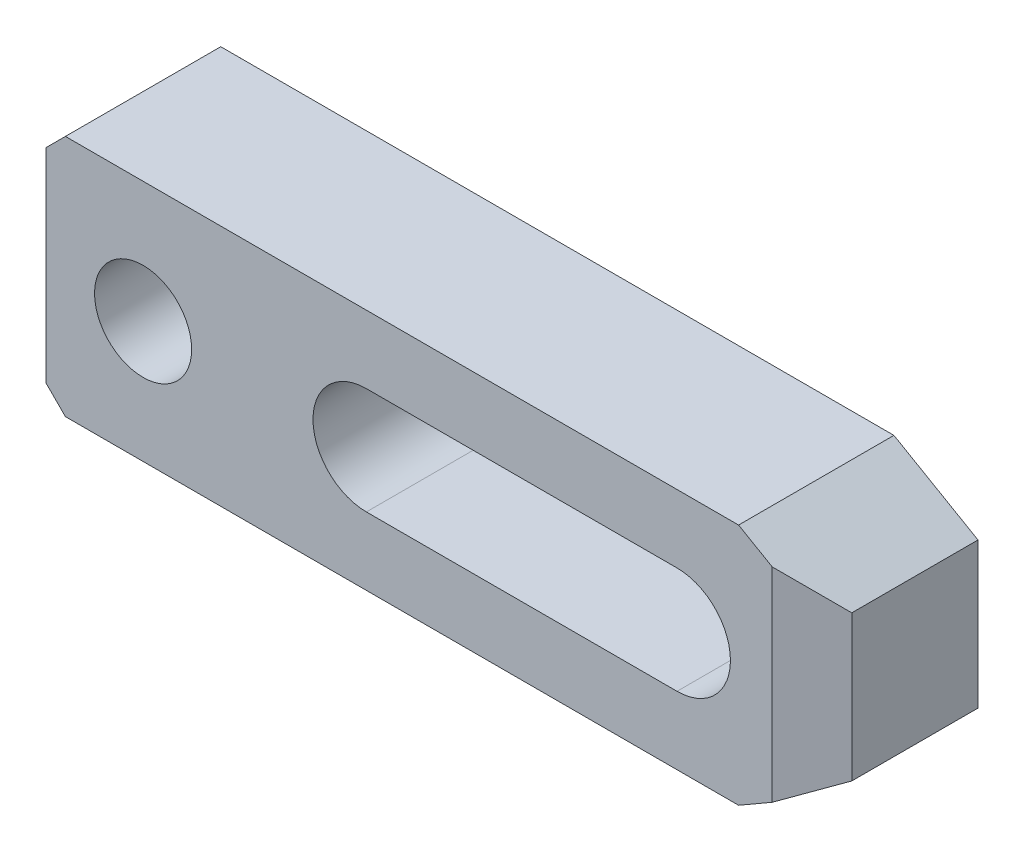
ISO-10303-21;
HEADER;
FILE_DESCRIPTION(('STEP AP214'),'2;1');
FILE_NAME('part.step','',(''),(''),'','','');
FILE_SCHEMA(('AUTOMOTIVE_DESIGN { 1 0 10303 214 1 1 1 1 }'));
ENDSEC;
DATA;
#1=APPLICATION_CONTEXT('core data for automotive mechanical design processes');
#2=APPLICATION_PROTOCOL_DEFINITION('international standard','automotive_design',2000,#1);
#3=PRODUCT_CONTEXT('',#1,'mechanical');
#4=PRODUCT('Part','Part','',(#3));
#5=PRODUCT_RELATED_PRODUCT_CATEGORY('part','',(#4));
#6=PRODUCT_DEFINITION_FORMATION('','',#4);
#7=PRODUCT_DEFINITION_CONTEXT('part definition',#1,'design');
#8=PRODUCT_DEFINITION('design','',#6,#7);
#9=PRODUCT_DEFINITION_SHAPE('','',#8);
#10=(LENGTH_UNIT() NAMED_UNIT(*) SI_UNIT(.MILLI.,.METRE.));
#11=(NAMED_UNIT(*) PLANE_ANGLE_UNIT() SI_UNIT($,.RADIAN.));
#12=(NAMED_UNIT(*) SI_UNIT($,.STERADIAN.) SOLID_ANGLE_UNIT());
#13=UNCERTAINTY_MEASURE_WITH_UNIT(LENGTH_MEASURE(1.E-05),#10,'distance_accuracy_value','');
#14=(GEOMETRIC_REPRESENTATION_CONTEXT(3) GLOBAL_UNCERTAINTY_ASSIGNED_CONTEXT((#13)) GLOBAL_UNIT_ASSIGNED_CONTEXT((#10,
#11,#12)) REPRESENTATION_CONTEXT('',''));
#15=CARTESIAN_POINT('',(0.,0.,0.));
#16=DIRECTION('',(0.,0.,1.));
#17=DIRECTION('',(1.,0.,0.));
#18=AXIS2_PLACEMENT_3D('',#15,#16,#17);
#19=CARTESIAN_POINT('',(-37.6198914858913,37.8801085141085,0.));
#20=DIRECTION('',(0.,0.,1.));
#21=DIRECTION('',(-1.,0.,0.));
#22=AXIS2_PLACEMENT_3D('',#19,#20,#21);
#23=PLANE('',#22);
#24=DIRECTION('',(0.,1.,0.));
#25=VECTOR('',#24,1.);
#26=CARTESIAN_POINT('',(-65.,-10.5,0.));
#27=LINE('',#26,#25);
#28=CARTESIAN_POINT('',(-65.,-10.5,0.));
#29=VERTEX_POINT('',#28);
#30=CARTESIAN_POINT('',(-65.,-5.5,0.));
#31=VERTEX_POINT('',#30);
#32=EDGE_CURVE('E147',#29,#31,#27,.T.);
#33=ORIENTED_EDGE('',*,*,#32,.T.);
#34=DIRECTION('',(-1.,0.,0.));
#35=VECTOR('',#34,1.);
#36=CARTESIAN_POINT('',(0.,-5.5,0.));
#37=LINE('',#36,#35);
#38=CARTESIAN_POINT('',(0.,-5.5,0.));
#39=VERTEX_POINT('',#38);
#40=EDGE_CURVE('E237',#39,#31,#37,.T.);
#41=ORIENTED_EDGE('',*,*,#40,.F.);
#42=CARTESIAN_POINT('',(0.,0.,0.));
#43=DIRECTION('',(0.,0.,1.));
#44=DIRECTION('',(-1.,0.,0.));
#45=AXIS2_PLACEMENT_3D('',#42,#43,#44);
#46=CIRCLE('',#45,5.5);
#47=CARTESIAN_POINT('',(0.,5.5,0.));
#48=VERTEX_POINT('',#47);
#49=EDGE_CURVE('E128',#39,#48,#46,.T.);
#50=ORIENTED_EDGE('',*,*,#49,.T.);
#51=DIRECTION('',(1.,0.,0.));
#52=VECTOR('',#51,1.);
#53=CARTESIAN_POINT('',(-32.,5.5,0.));
#54=LINE('',#53,#52);
#55=CARTESIAN_POINT('',(-65.,5.5,0.));
#56=VERTEX_POINT('',#55);
#57=EDGE_CURVE('E119',#56,#48,#54,.T.);
#58=ORIENTED_EDGE('',*,*,#57,.F.);
#59=CARTESIAN_POINT('',(-65.,10.5,0.));
#60=VERTEX_POINT('',#59);
#61=EDGE_CURVE('E124',#56,#60,#27,.T.);
#62=ORIENTED_EDGE('',*,*,#61,.T.);
#63=DIRECTION('',(-0.70710678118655,-0.707106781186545,0.));
#64=VECTOR('',#63,1.);
#65=CARTESIAN_POINT('',(-63.,12.5,0.));
#66=LINE('',#65,#64);
#67=CARTESIAN_POINT('',(-63.,12.5,0.));
#68=VERTEX_POINT('',#67);
#69=EDGE_CURVE('E148',#68,#60,#66,.T.);
#70=ORIENTED_EDGE('',*,*,#69,.F.);
#71=DIRECTION('',(-1.,0.,0.));
#72=VECTOR('',#71,1.);
#73=CARTESIAN_POINT('',(6.3397459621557,12.5,0.));
#74=LINE('',#73,#72);
#75=CARTESIAN_POINT('',(6.3397459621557,12.5,0.));
#76=VERTEX_POINT('',#75);
#77=EDGE_CURVE('E151',#76,#68,#74,.T.);
#78=ORIENTED_EDGE('',*,*,#77,.F.);
#79=DIRECTION('',(-0.866025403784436,0.5,0.));
#80=VECTOR('',#79,1.);
#81=CARTESIAN_POINT('',(15.,7.5,0.));
#82=LINE('',#81,#80);
#83=CARTESIAN_POINT('',(15.,7.5,0.));
#84=VERTEX_POINT('',#83);
#85=EDGE_CURVE('E158',#84,#76,#82,.T.);
#86=ORIENTED_EDGE('',*,*,#85,.F.);
#87=DIRECTION('',(0.,-1.,0.));
#88=VECTOR('',#87,1.);
#89=CARTESIAN_POINT('',(15.,7.5,0.));
#90=LINE('',#89,#88);
#91=CARTESIAN_POINT('',(15.,-7.5,0.));
#92=VERTEX_POINT('',#91);
#93=EDGE_CURVE('E181',#84,#92,#90,.T.);
#94=ORIENTED_EDGE('',*,*,#93,.T.);
#95=DIRECTION('',(-0.86602540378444,-0.5,0.));
#96=VECTOR('',#95,1.);
#97=CARTESIAN_POINT('',(15.,-7.5,0.));
#98=LINE('',#97,#96);
#99=CARTESIAN_POINT('',(6.33974596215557,-12.5,0.));
#100=VERTEX_POINT('',#99);
#101=EDGE_CURVE('E208',#92,#100,#98,.T.);
#102=ORIENTED_EDGE('',*,*,#101,.T.);
#103=DIRECTION('',(-1.,0.,0.));
#104=VECTOR('',#103,1.);
#105=CARTESIAN_POINT('',(6.33974596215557,-12.5,0.));
#106=LINE('',#105,#104);
#107=CARTESIAN_POINT('',(-63.,-12.5,0.));
#108=VERTEX_POINT('',#107);
#109=EDGE_CURVE('E210',#100,#108,#106,.T.);
#110=ORIENTED_EDGE('',*,*,#109,.T.);
#111=DIRECTION('',(-0.707106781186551,0.707106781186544,0.));
#112=VECTOR('',#111,1.);
#113=CARTESIAN_POINT('',(-63.,-12.5,0.));
#114=LINE('',#113,#112);
#115=EDGE_CURVE('E150',#108,#29,#114,.T.);
#116=ORIENTED_EDGE('',*,*,#115,.T.);
#117=EDGE_LOOP('',(#33,#41,#50,#58,#62,#70,#78,#86,#94,#102,#110,#116));
#118=FACE_BOUND('',#117,.T.);
#119=ADVANCED_FACE('F14',(#118),#23,.F.);
#120=CARTESIAN_POINT('',(-65.,-10.5,16.));
#121=DIRECTION('',(-1.,0.,0.));
#122=DIRECTION('',(0.,0.,-1.));
#123=AXIS2_PLACEMENT_3D('',#120,#121,#122);
#124=PLANE('',#123);
#125=DIRECTION('',(0.,-1.,0.));
#126=VECTOR('',#125,1.);
#127=CARTESIAN_POINT('',(-65.,-10.5,5.));
#128=LINE('',#127,#126);
#129=CARTESIAN_POINT('',(-65.,5.5,5.));
#130=VERTEX_POINT('',#129);
#131=CARTESIAN_POINT('',(-65.,-5.5,5.));
#132=VERTEX_POINT('',#131);
#133=EDGE_CURVE('E141',#130,#132,#128,.T.);
#134=ORIENTED_EDGE('',*,*,#133,.T.);
#135=DIRECTION('',(0.,0.,-1.));
#136=VECTOR('',#135,1.);
#137=CARTESIAN_POINT('',(-65.,-5.5,16.));
#138=LINE('',#137,#136);
#139=EDGE_CURVE('E140',#132,#31,#138,.T.);
#140=ORIENTED_EDGE('',*,*,#139,.T.);
#141=ORIENTED_EDGE('',*,*,#32,.F.);
#142=DIRECTION('',(0.,0.,-1.));
#143=VECTOR('',#142,1.);
#144=CARTESIAN_POINT('',(-65.,-10.5,16.));
#145=LINE('',#144,#143);
#146=CARTESIAN_POINT('',(-65.,-10.5,16.));
#147=VERTEX_POINT('',#146);
#148=EDGE_CURVE('E189',#147,#29,#145,.T.);
#149=ORIENTED_EDGE('',*,*,#148,.F.);
#150=DIRECTION('',(0.,1.,0.));
#151=VECTOR('',#150,1.);
#152=CARTESIAN_POINT('',(-65.,-10.5,16.));
#153=LINE('',#152,#151);
#154=CARTESIAN_POINT('',(-65.,10.5,16.));
#155=VERTEX_POINT('',#154);
#156=EDGE_CURVE('E171',#147,#155,#153,.T.);
#157=ORIENTED_EDGE('',*,*,#156,.T.);
#158=DIRECTION('',(0.,0.,-1.));
#159=VECTOR('',#158,1.);
#160=CARTESIAN_POINT('',(-65.,10.5,16.));
#161=LINE('',#160,#159);
#162=EDGE_CURVE('E145',#155,#60,#161,.T.);
#163=ORIENTED_EDGE('',*,*,#162,.T.);
#164=ORIENTED_EDGE('',*,*,#61,.F.);
#165=DIRECTION('',(0.,0.,-1.));
#166=VECTOR('',#165,1.);
#167=CARTESIAN_POINT('',(-65.,5.5,16.));
#168=LINE('',#167,#166);
#169=EDGE_CURVE('E135',#130,#56,#168,.T.);
#170=ORIENTED_EDGE('',*,*,#169,.F.);
#171=EDGE_LOOP('',(#134,#140,#141,#149,#157,#163,#164,#170));
#172=FACE_BOUND('',#171,.T.);
#173=ADVANCED_FACE('F143',(#172),#124,.T.);
#174=CARTESIAN_POINT('',(-55.,0.,16.));
#175=DIRECTION('',(0.,0.,-1.));
#176=DIRECTION('',(1.,0.,0.));
#177=AXIS2_PLACEMENT_3D('',#174,#175,#176);
#178=CYLINDRICAL_SURFACE('',#177,5.);
#179=CARTESIAN_POINT('',(-55.,0.,16.));
#180=DIRECTION('',(0.,0.,1.));
#181=DIRECTION('',(-1.,0.,0.));
#182=AXIS2_PLACEMENT_3D('',#179,#180,#181);
#183=CIRCLE('',#182,5.);
#184=CARTESIAN_POINT('',(-60.,0.,16.));
#185=VERTEX_POINT('',#184);
#186=EDGE_CURVE('E161',#185,#185,#183,.T.);
#187=ORIENTED_EDGE('',*,*,#186,.T.);
#188=EDGE_LOOP('',(#187));
#189=FACE_BOUND('',#188,.T.);
#190=CARTESIAN_POINT('',(-55.,0.,5.));
#191=DIRECTION('',(0.,0.,-1.));
#192=DIRECTION('',(1.,0.,0.));
#193=AXIS2_PLACEMENT_3D('',#190,#191,#192);
#194=CIRCLE('',#193,5.);
#195=CARTESIAN_POINT('',(-50.,0.,5.));
#196=VERTEX_POINT('',#195);
#197=EDGE_CURVE('E398',#196,#196,#194,.T.);
#198=ORIENTED_EDGE('',*,*,#197,.T.);
#199=EDGE_LOOP('',(#198));
#200=FACE_BOUND('',#199,.T.);
#201=ADVANCED_FACE('F262',(#189,#200),#178,.F.);
#202=CARTESIAN_POINT('',(-32.,0.,16.));
#203=DIRECTION('',(0.,0.,-1.));
#204=DIRECTION('',(1.,0.,0.));
#205=AXIS2_PLACEMENT_3D('',#202,#203,#204);
#206=CYLINDRICAL_SURFACE('',#205,5.5);
#207=DIRECTION('',(0.,0.,-1.));
#208=VECTOR('',#207,1.);
#209=CARTESIAN_POINT('',(-32.,-5.5,16.));
#210=LINE('',#209,#208);
#211=CARTESIAN_POINT('',(-32.,-5.5,16.));
#212=VERTEX_POINT('',#211);
#213=CARTESIAN_POINT('',(-32.,-5.5,5.));
#214=VERTEX_POINT('',#213);
#215=EDGE_CURVE('E256',#212,#214,#210,.T.);
#216=ORIENTED_EDGE('',*,*,#215,.T.);
#217=CARTESIAN_POINT('',(-32.,0.,5.));
#218=DIRECTION('',(0.,0.,-1.));
#219=DIRECTION('',(1.,0.,0.));
#220=AXIS2_PLACEMENT_3D('',#217,#218,#219);
#221=CIRCLE('',#220,5.5);
#222=CARTESIAN_POINT('',(-32.,5.5,5.));
#223=VERTEX_POINT('',#222);
#224=EDGE_CURVE('E278',#214,#223,#221,.T.);
#225=ORIENTED_EDGE('',*,*,#224,.T.);
#226=DIRECTION('',(0.,0.,-1.));
#227=VECTOR('',#226,1.);
#228=CARTESIAN_POINT('',(-32.,5.5,16.));
#229=LINE('',#228,#227);
#230=CARTESIAN_POINT('',(-32.,5.5,16.));
#231=VERTEX_POINT('',#230);
#232=EDGE_CURVE('E244',#231,#223,#229,.T.);
#233=ORIENTED_EDGE('',*,*,#232,.F.);
#234=CARTESIAN_POINT('',(-32.,0.,16.));
#235=DIRECTION('',(0.,0.,1.));
#236=DIRECTION('',(-1.,0.,0.));
#237=AXIS2_PLACEMENT_3D('',#234,#235,#236);
#238=CIRCLE('',#237,5.5);
#239=EDGE_CURVE('E132',#231,#212,#238,.T.);
#240=ORIENTED_EDGE('',*,*,#239,.T.);
#241=EDGE_LOOP('',(#216,#225,#233,#240));
#242=FACE_BOUND('',#241,.T.);
#243=ADVANCED_FACE('F269',(#242),#206,.F.);
#244=CARTESIAN_POINT('',(-37.6198914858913,37.8801085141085,16.));
#245=DIRECTION('',(0.,0.,1.));
#246=DIRECTION('',(-1.,0.,0.));
#247=AXIS2_PLACEMENT_3D('',#244,#245,#246);
#248=PLANE('',#247);
#249=DIRECTION('',(0.,-1.,0.));
#250=VECTOR('',#249,1.);
#251=CARTESIAN_POINT('',(9.80384757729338,37.8801085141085,16.));
#252=LINE('',#251,#250);
#253=CARTESIAN_POINT('',(9.80384757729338,10.5,16.));
#254=VERTEX_POINT('',#253);
#255=CARTESIAN_POINT('',(9.80384757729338,-10.5,16.));
#256=VERTEX_POINT('',#255);
#257=EDGE_CURVE('E233',#254,#256,#252,.T.);
#258=ORIENTED_EDGE('',*,*,#257,.F.);
#259=DIRECTION('',(-0.866025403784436,0.5,0.));
#260=VECTOR('',#259,1.);
#261=CARTESIAN_POINT('',(15.,7.5,16.));
#262=LINE('',#261,#260);
#263=CARTESIAN_POINT('',(6.3397459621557,12.5,16.));
#264=VERTEX_POINT('',#263);
#265=EDGE_CURVE('E179',#254,#264,#262,.T.);
#266=ORIENTED_EDGE('',*,*,#265,.T.);
#267=DIRECTION('',(-1.,0.,0.));
#268=VECTOR('',#267,1.);
#269=CARTESIAN_POINT('',(6.3397459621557,12.5,16.));
#270=LINE('',#269,#268);
#271=CARTESIAN_POINT('',(-63.,12.5,16.));
#272=VERTEX_POINT('',#271);
#273=EDGE_CURVE('E176',#264,#272,#270,.T.);
#274=ORIENTED_EDGE('',*,*,#273,.T.);
#275=DIRECTION('',(-0.70710678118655,-0.707106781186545,0.));
#276=VECTOR('',#275,1.);
#277=CARTESIAN_POINT('',(-63.,12.5,16.));
#278=LINE('',#277,#276);
#279=EDGE_CURVE('E173',#272,#155,#278,.T.);
#280=ORIENTED_EDGE('',*,*,#279,.T.);
#281=ORIENTED_EDGE('',*,*,#156,.F.);
#282=DIRECTION('',(-0.707106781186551,0.707106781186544,0.));
#283=VECTOR('',#282,1.);
#284=CARTESIAN_POINT('',(-63.,-12.5,16.));
#285=LINE('',#284,#283);
#286=CARTESIAN_POINT('',(-63.,-12.5,16.));
#287=VERTEX_POINT('',#286);
#288=EDGE_CURVE('E168',#287,#147,#285,.T.);
#289=ORIENTED_EDGE('',*,*,#288,.F.);
#290=DIRECTION('',(-1.,0.,0.));
#291=VECTOR('',#290,1.);
#292=CARTESIAN_POINT('',(6.33974596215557,-12.5,16.));
#293=LINE('',#292,#291);
#294=CARTESIAN_POINT('',(6.33974596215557,-12.5,16.));
#295=VERTEX_POINT('',#294);
#296=EDGE_CURVE('E165',#295,#287,#293,.T.);
#297=ORIENTED_EDGE('',*,*,#296,.F.);
#298=DIRECTION('',(-0.86602540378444,-0.5,0.));
#299=VECTOR('',#298,1.);
#300=CARTESIAN_POINT('',(15.,-7.5,16.));
#301=LINE('',#300,#299);
#302=EDGE_CURVE('E162',#256,#295,#301,.T.);
#303=ORIENTED_EDGE('',*,*,#302,.F.);
#304=EDGE_LOOP('',(#258,#266,#274,#280,#281,#289,#297,#303));
#305=FACE_BOUND('',#304,.T.);
#306=ORIENTED_EDGE('',*,*,#186,.F.);
#307=EDGE_LOOP('',(#306));
#308=FACE_BOUND('',#307,.T.);
#309=DIRECTION('',(-1.,0.,0.));
#310=VECTOR('',#309,1.);
#311=CARTESIAN_POINT('',(0.,-5.5,16.));
#312=LINE('',#311,#310);
#313=CARTESIAN_POINT('',(0.,-5.5,16.));
#314=VERTEX_POINT('',#313);
#315=EDGE_CURVE('E247',#314,#212,#312,.T.);
#316=ORIENTED_EDGE('',*,*,#315,.T.);
#317=ORIENTED_EDGE('',*,*,#239,.F.);
#318=DIRECTION('',(1.,0.,0.));
#319=VECTOR('',#318,1.);
#320=CARTESIAN_POINT('',(-32.,5.5,16.));
#321=LINE('',#320,#319);
#322=CARTESIAN_POINT('',(0.,5.5,16.));
#323=VERTEX_POINT('',#322);
#324=EDGE_CURVE('E241',#231,#323,#321,.T.);
#325=ORIENTED_EDGE('',*,*,#324,.T.);
#326=CARTESIAN_POINT('',(0.,0.,16.));
#327=DIRECTION('',(0.,0.,1.));
#328=DIRECTION('',(-1.,0.,0.));
#329=AXIS2_PLACEMENT_3D('',#326,#327,#328);
#330=CIRCLE('',#329,5.5);
#331=EDGE_CURVE('E245',#314,#323,#330,.T.);
#332=ORIENTED_EDGE('',*,*,#331,.F.);
#333=EDGE_LOOP('',(#316,#317,#325,#332));
#334=FACE_BOUND('',#333,.T.);
#335=ADVANCED_FACE('F265',(#305,#308,#334),#248,.T.);
#336=CARTESIAN_POINT('',(15.,7.5,16.));
#337=DIRECTION('',(-0.5,-0.866025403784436,0.));
#338=DIRECTION('',(0.866025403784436,-0.5,0.));
#339=AXIS2_PLACEMENT_3D('',#336,#337,#338);
#340=PLANE('',#339);
#341=ORIENTED_EDGE('',*,*,#265,.F.);
#342=DIRECTION('',(0.774596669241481,-0.447213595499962,-0.447213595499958));
#343=VECTOR('',#342,1.);
#344=CARTESIAN_POINT('',(13.9607695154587,8.1,13.6));
#345=LINE('',#344,#343);
#346=CARTESIAN_POINT('',(15.,7.5,13.));
#347=VERTEX_POINT('',#346);
#348=EDGE_CURVE('E235',#254,#347,#345,.T.);
#349=ORIENTED_EDGE('',*,*,#348,.T.);
#350=DIRECTION('',(0.,0.,-1.));
#351=VECTOR('',#350,1.);
#352=CARTESIAN_POINT('',(15.,7.5,16.));
#353=LINE('',#352,#351);
#354=EDGE_CURVE('E164',#347,#84,#353,.T.);
#355=ORIENTED_EDGE('',*,*,#354,.T.);
#356=ORIENTED_EDGE('',*,*,#85,.T.);
#357=DIRECTION('',(0.,0.,-1.));
#358=VECTOR('',#357,1.);
#359=CARTESIAN_POINT('',(6.3397459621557,12.5,16.));
#360=LINE('',#359,#358);
#361=EDGE_CURVE('E9',#264,#76,#360,.T.);
#362=ORIENTED_EDGE('',*,*,#361,.F.);
#363=EDGE_LOOP('',(#341,#349,#355,#356,#362));
#364=FACE_BOUND('',#363,.T.);
#365=ADVANCED_FACE('F268',(#364),#340,.F.);
#366=CARTESIAN_POINT('',(6.3397459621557,12.5,16.));
#367=DIRECTION('',(0.,-1.,0.));
#368=DIRECTION('',(0.,0.,1.));
#369=AXIS2_PLACEMENT_3D('',#366,#367,#368);
#370=PLANE('',#369);
#371=DIRECTION('',(0.,0.,-1.));
#372=VECTOR('',#371,1.);
#373=CARTESIAN_POINT('',(-63.,12.5,16.));
#374=LINE('',#373,#372);
#375=EDGE_CURVE('E22',#272,#68,#374,.T.);
#376=ORIENTED_EDGE('',*,*,#375,.F.);
#377=ORIENTED_EDGE('',*,*,#273,.F.);
#378=ORIENTED_EDGE('',*,*,#361,.T.);
#379=ORIENTED_EDGE('',*,*,#77,.T.);
#380=EDGE_LOOP('',(#376,#377,#378,#379));
#381=FACE_BOUND('',#380,.T.);
#382=ADVANCED_FACE('F16',(#381),#370,.F.);
#383=CARTESIAN_POINT('',(-63.,12.5,16.));
#384=DIRECTION('',(0.707106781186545,-0.70710678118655,0.));
#385=DIRECTION('',(0.70710678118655,0.707106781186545,0.));
#386=AXIS2_PLACEMENT_3D('',#383,#384,#385);
#387=PLANE('',#386);
#388=ORIENTED_EDGE('',*,*,#162,.F.);
#389=ORIENTED_EDGE('',*,*,#279,.F.);
#390=ORIENTED_EDGE('',*,*,#375,.T.);
#391=ORIENTED_EDGE('',*,*,#69,.T.);
#392=EDGE_LOOP('',(#388,#389,#390,#391));
#393=FACE_BOUND('',#392,.T.);
#394=ADVANCED_FACE('F193',(#393),#387,.F.);
#395=CARTESIAN_POINT('',(-63.,-12.5,16.));
#396=DIRECTION('',(-0.707106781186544,-0.707106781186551,0.));
#397=DIRECTION('',(0.707106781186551,-0.707106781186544,0.));
#398=AXIS2_PLACEMENT_3D('',#395,#396,#397);
#399=PLANE('',#398);
#400=DIRECTION('',(0.,0.,-1.));
#401=VECTOR('',#400,1.);
#402=CARTESIAN_POINT('',(-63.,-12.5,16.));
#403=LINE('',#402,#401);
#404=EDGE_CURVE('E187',#287,#108,#403,.T.);
#405=ORIENTED_EDGE('',*,*,#404,.F.);
#406=ORIENTED_EDGE('',*,*,#288,.T.);
#407=ORIENTED_EDGE('',*,*,#148,.T.);
#408=ORIENTED_EDGE('',*,*,#115,.F.);
#409=EDGE_LOOP('',(#405,#406,#407,#408));
#410=FACE_BOUND('',#409,.T.);
#411=ADVANCED_FACE('F220',(#410),#399,.T.);
#412=CARTESIAN_POINT('',(6.33974596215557,-12.5,16.));
#413=DIRECTION('',(0.,-1.,0.));
#414=DIRECTION('',(0.,0.,1.));
#415=AXIS2_PLACEMENT_3D('',#412,#413,#414);
#416=PLANE('',#415);
#417=DIRECTION('',(0.,0.,-1.));
#418=VECTOR('',#417,1.);
#419=CARTESIAN_POINT('',(6.33974596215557,-12.5,16.));
#420=LINE('',#419,#418);
#421=EDGE_CURVE('E185',#295,#100,#420,.T.);
#422=ORIENTED_EDGE('',*,*,#421,.F.);
#423=ORIENTED_EDGE('',*,*,#296,.T.);
#424=ORIENTED_EDGE('',*,*,#404,.T.);
#425=ORIENTED_EDGE('',*,*,#109,.F.);
#426=EDGE_LOOP('',(#422,#423,#424,#425));
#427=FACE_BOUND('',#426,.T.);
#428=ADVANCED_FACE('F306',(#427),#416,.T.);
#429=CARTESIAN_POINT('',(15.,-7.5,16.));
#430=DIRECTION('',(0.5,-0.86602540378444,0.));
#431=DIRECTION('',(0.86602540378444,0.5,0.));
#432=AXIS2_PLACEMENT_3D('',#429,#430,#431);
#433=PLANE('',#432);
#434=DIRECTION('',(0.774596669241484,0.447213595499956,-0.44721359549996));
#435=VECTOR('',#434,1.);
#436=CARTESIAN_POINT('',(13.9607695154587,-8.1,13.6));
#437=LINE('',#436,#435);
#438=CARTESIAN_POINT('',(15.,-7.5,13.));
#439=VERTEX_POINT('',#438);
#440=EDGE_CURVE('E37',#256,#439,#437,.T.);
#441=ORIENTED_EDGE('',*,*,#440,.F.);
#442=ORIENTED_EDGE('',*,*,#302,.T.);
#443=ORIENTED_EDGE('',*,*,#421,.T.);
#444=ORIENTED_EDGE('',*,*,#101,.F.);
#445=DIRECTION('',(0.,0.,-1.));
#446=VECTOR('',#445,1.);
#447=CARTESIAN_POINT('',(15.,-7.5,16.));
#448=LINE('',#447,#446);
#449=EDGE_CURVE('E183',#439,#92,#448,.T.);
#450=ORIENTED_EDGE('',*,*,#449,.F.);
#451=EDGE_LOOP('',(#441,#442,#443,#444,#450));
#452=FACE_BOUND('',#451,.T.);
#453=ADVANCED_FACE('F303',(#452),#433,.T.);
#454=CARTESIAN_POINT('',(15.,7.5,16.));
#455=DIRECTION('',(1.,0.,0.));
#456=DIRECTION('',(0.,0.,1.));
#457=AXIS2_PLACEMENT_3D('',#454,#455,#456);
#458=PLANE('',#457);
#459=DIRECTION('',(0.,-1.,0.));
#460=VECTOR('',#459,1.);
#461=CARTESIAN_POINT('',(15.,20.,13.));
#462=LINE('',#461,#460);
#463=EDGE_CURVE('E227',#347,#439,#462,.T.);
#464=ORIENTED_EDGE('',*,*,#463,.T.);
#465=ORIENTED_EDGE('',*,*,#449,.T.);
#466=ORIENTED_EDGE('',*,*,#93,.F.);
#467=ORIENTED_EDGE('',*,*,#354,.F.);
#468=EDGE_LOOP('',(#464,#465,#466,#467));
#469=FACE_BOUND('',#468,.T.);
#470=ADVANCED_FACE('F205',(#469),#458,.T.);
#471=CARTESIAN_POINT('',(0.,-5.5,16.));
#472=DIRECTION('',(0.,-1.,0.));
#473=DIRECTION('',(1.,0.,0.));
#474=AXIS2_PLACEMENT_3D('',#471,#472,#473);
#475=PLANE('',#474);
#476=ORIENTED_EDGE('',*,*,#40,.T.);
#477=ORIENTED_EDGE('',*,*,#139,.F.);
#478=DIRECTION('',(1.,0.,0.));
#479=VECTOR('',#478,1.);
#480=CARTESIAN_POINT('',(-75.,-5.5,5.));
#481=LINE('',#480,#479);
#482=EDGE_CURVE('E276',#132,#214,#481,.T.);
#483=ORIENTED_EDGE('',*,*,#482,.T.);
#484=ORIENTED_EDGE('',*,*,#215,.F.);
#485=ORIENTED_EDGE('',*,*,#315,.F.);
#486=DIRECTION('',(0.,0.,-1.));
#487=VECTOR('',#486,1.);
#488=CARTESIAN_POINT('',(0.,-5.5,16.));
#489=LINE('',#488,#487);
#490=EDGE_CURVE('E255',#314,#39,#489,.T.);
#491=ORIENTED_EDGE('',*,*,#490,.T.);
#492=EDGE_LOOP('',(#476,#477,#483,#484,#485,#491));
#493=FACE_BOUND('',#492,.T.);
#494=ADVANCED_FACE('F275',(#493),#475,.F.);
#495=CARTESIAN_POINT('',(0.,0.,16.));
#496=DIRECTION('',(0.,0.,-1.));
#497=DIRECTION('',(1.,0.,0.));
#498=AXIS2_PLACEMENT_3D('',#495,#496,#497);
#499=CYLINDRICAL_SURFACE('',#498,5.5);
#500=DIRECTION('',(0.,0.,-1.));
#501=VECTOR('',#500,1.);
#502=CARTESIAN_POINT('',(0.,5.5,16.));
#503=LINE('',#502,#501);
#504=EDGE_CURVE('E253',#323,#48,#503,.T.);
#505=ORIENTED_EDGE('',*,*,#504,.T.);
#506=ORIENTED_EDGE('',*,*,#49,.F.);
#507=ORIENTED_EDGE('',*,*,#490,.F.);
#508=ORIENTED_EDGE('',*,*,#331,.T.);
#509=EDGE_LOOP('',(#505,#506,#507,#508));
#510=FACE_BOUND('',#509,.T.);
#511=ADVANCED_FACE('F280',(#510),#499,.F.);
#512=CARTESIAN_POINT('',(-32.,5.5,16.));
#513=DIRECTION('',(0.,1.,0.));
#514=DIRECTION('',(0.,0.,-1.));
#515=AXIS2_PLACEMENT_3D('',#512,#513,#514);
#516=PLANE('',#515);
#517=ORIENTED_EDGE('',*,*,#57,.T.);
#518=ORIENTED_EDGE('',*,*,#504,.F.);
#519=ORIENTED_EDGE('',*,*,#324,.F.);
#520=ORIENTED_EDGE('',*,*,#232,.T.);
#521=DIRECTION('',(1.,0.,0.));
#522=VECTOR('',#521,1.);
#523=CARTESIAN_POINT('',(-75.,5.5,5.));
#524=LINE('',#523,#522);
#525=EDGE_CURVE('E29',#130,#223,#524,.T.);
#526=ORIENTED_EDGE('',*,*,#525,.F.);
#527=ORIENTED_EDGE('',*,*,#169,.T.);
#528=EDGE_LOOP('',(#517,#518,#519,#520,#526,#527));
#529=FACE_BOUND('',#528,.T.);
#530=ADVANCED_FACE('F136',(#529),#516,.F.);
#531=CARTESIAN_POINT('',(2.87564434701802,20.,20.));
#532=DIRECTION('',(-0.5,0.,-0.866025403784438));
#533=DIRECTION('',(0.866025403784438,0.,-0.5));
#534=AXIS2_PLACEMENT_3D('',#531,#532,#533);
#535=PLANE('',#534);
#536=ORIENTED_EDGE('',*,*,#257,.T.);
#537=ORIENTED_EDGE('',*,*,#440,.T.);
#538=ORIENTED_EDGE('',*,*,#463,.F.);
#539=ORIENTED_EDGE('',*,*,#348,.F.);
#540=EDGE_LOOP('',(#536,#537,#538,#539));
#541=FACE_BOUND('',#540,.T.);
#542=ADVANCED_FACE('F288',(#541),#535,.F.);
#543=CARTESIAN_POINT('',(-75.,-5.5,5.));
#544=DIRECTION('',(0.,0.,-1.));
#545=DIRECTION('',(1.,0.,0.));
#546=AXIS2_PLACEMENT_3D('',#543,#544,#545);
#547=PLANE('',#546);
#548=ORIENTED_EDGE('',*,*,#197,.F.);
#549=EDGE_LOOP('',(#548));
#550=FACE_BOUND('',#549,.T.);
#551=ORIENTED_EDGE('',*,*,#525,.T.);
#552=ORIENTED_EDGE('',*,*,#224,.F.);
#553=ORIENTED_EDGE('',*,*,#482,.F.);
#554=ORIENTED_EDGE('',*,*,#133,.F.);
#555=EDGE_LOOP('',(#551,#552,#553,#554));
#556=FACE_BOUND('',#555,.T.);
#557=ADVANCED_FACE('F384',(#550,#556),#547,.T.);
#558=CLOSED_SHELL('',(#119,#173,#201,#243,#335,#365,#382,#394,#411,#428,#453,#470,#494,#511,
#530,#542,#557));
#559=MANIFOLD_SOLID_BREP('B1',#558);
#560=ADVANCED_BREP_SHAPE_REPRESENTATION('',(#18,#559),#14);
#561=SHAPE_DEFINITION_REPRESENTATION(#9,#560);
ENDSEC;
END-ISO-10303-21;
